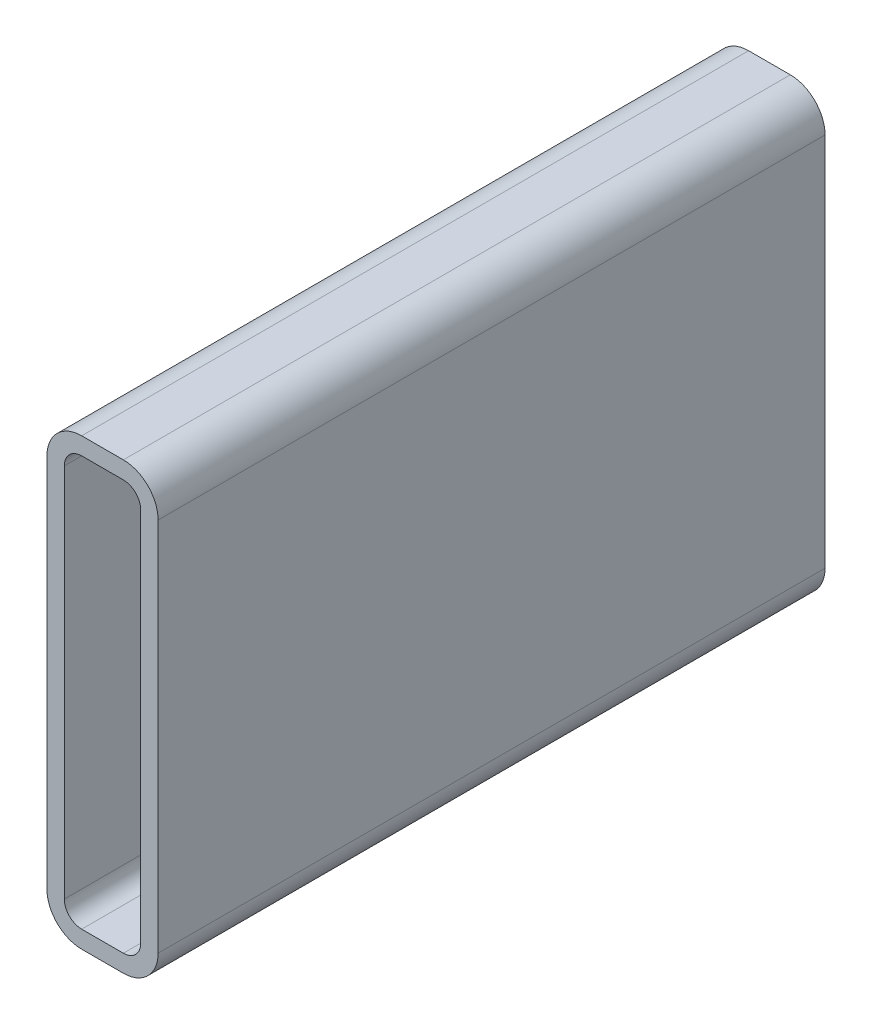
ISO-10303-21;
HEADER;
FILE_DESCRIPTION(('STEP AP214'),'2;1');
FILE_NAME('part.step','',(''),(''),'','','');
FILE_SCHEMA(('AUTOMOTIVE_DESIGN { 1 0 10303 214 1 1 1 1 }'));
ENDSEC;
DATA;
#1=APPLICATION_CONTEXT('core data for automotive mechanical design processes');
#2=APPLICATION_PROTOCOL_DEFINITION('international standard','automotive_design',2000,#1);
#3=PRODUCT_CONTEXT('',#1,'mechanical');
#4=PRODUCT('Part','Part','',(#3));
#5=PRODUCT_RELATED_PRODUCT_CATEGORY('part','',(#4));
#6=PRODUCT_DEFINITION_FORMATION('','',#4);
#7=PRODUCT_DEFINITION_CONTEXT('part definition',#1,'design');
#8=PRODUCT_DEFINITION('design','',#6,#7);
#9=PRODUCT_DEFINITION_SHAPE('','',#8);
#10=(LENGTH_UNIT() NAMED_UNIT(*) SI_UNIT(.MILLI.,.METRE.));
#11=(NAMED_UNIT(*) PLANE_ANGLE_UNIT() SI_UNIT($,.RADIAN.));
#12=(NAMED_UNIT(*) SI_UNIT($,.STERADIAN.) SOLID_ANGLE_UNIT());
#13=UNCERTAINTY_MEASURE_WITH_UNIT(LENGTH_MEASURE(1.E-05),#10,'distance_accuracy_value','');
#14=(GEOMETRIC_REPRESENTATION_CONTEXT(3) GLOBAL_UNCERTAINTY_ASSIGNED_CONTEXT((#13)) GLOBAL_UNIT_ASSIGNED_CONTEXT((#10,
#11,#12)) REPRESENTATION_CONTEXT('',''));
#15=CARTESIAN_POINT('',(0.,0.,0.));
#16=DIRECTION('',(0.,0.,1.));
#17=DIRECTION('',(1.,0.,0.));
#18=AXIS2_PLACEMENT_3D('',#15,#16,#17);
#19=CARTESIAN_POINT('',(15.875,187.325,304.8));
#20=DIRECTION('',(0.,0.,1.));
#21=DIRECTION('',(1.,0.,0.));
#22=AXIS2_PLACEMENT_3D('',#19,#20,#21);
#23=PLANE('',#22);
#24=CARTESIAN_POINT('',(15.875,187.325,304.8));
#25=DIRECTION('',(0.,0.,1.));
#26=DIRECTION('',(1.,0.,0.));
#27=AXIS2_PLACEMENT_3D('',#24,#25,#26);
#28=CIRCLE('',#27,15.875);
#29=CARTESIAN_POINT('',(15.875,203.2,304.8));
#30=VERTEX_POINT('',#29);
#31=CARTESIAN_POINT('',(0.,187.325,304.8));
#32=VERTEX_POINT('',#31);
#33=EDGE_CURVE('E211',#30,#32,#28,.T.);
#34=ORIENTED_EDGE('',*,*,#33,.T.);
#35=DIRECTION('',(0.,-1.,0.));
#36=VECTOR('',#35,1.);
#37=CARTESIAN_POINT('',(0.,15.875,304.8));
#38=LINE('',#37,#36);
#39=CARTESIAN_POINT('',(0.,15.875,304.8));
#40=VERTEX_POINT('',#39);
#41=EDGE_CURVE('E214',#32,#40,#38,.T.);
#42=ORIENTED_EDGE('',*,*,#41,.T.);
#43=CARTESIAN_POINT('',(15.875,15.875,304.8));
#44=DIRECTION('',(0.,0.,1.));
#45=DIRECTION('',(1.,0.,0.));
#46=AXIS2_PLACEMENT_3D('',#43,#44,#45);
#47=CIRCLE('',#46,15.875);
#48=CARTESIAN_POINT('',(15.875,0.,304.8));
#49=VERTEX_POINT('',#48);
#50=EDGE_CURVE('E217',#40,#49,#47,.T.);
#51=ORIENTED_EDGE('',*,*,#50,.T.);
#52=DIRECTION('',(1.,0.,0.));
#53=VECTOR('',#52,1.);
#54=CARTESIAN_POINT('',(34.925,0.,304.8));
#55=LINE('',#54,#53);
#56=CARTESIAN_POINT('',(34.925,0.,304.8));
#57=VERTEX_POINT('',#56);
#58=EDGE_CURVE('E219',#49,#57,#55,.T.);
#59=ORIENTED_EDGE('',*,*,#58,.T.);
#60=CARTESIAN_POINT('',(34.925,15.875,304.8));
#61=DIRECTION('',(0.,0.,1.));
#62=DIRECTION('',(1.,0.,0.));
#63=AXIS2_PLACEMENT_3D('',#60,#61,#62);
#64=CIRCLE('',#63,15.875);
#65=CARTESIAN_POINT('',(50.8,15.875,304.8));
#66=VERTEX_POINT('',#65);
#67=EDGE_CURVE('E221',#57,#66,#64,.T.);
#68=ORIENTED_EDGE('',*,*,#67,.T.);
#69=DIRECTION('',(0.,1.,0.));
#70=VECTOR('',#69,1.);
#71=CARTESIAN_POINT('',(50.8,187.325,304.8));
#72=LINE('',#71,#70);
#73=CARTESIAN_POINT('',(50.8,187.325,304.8));
#74=VERTEX_POINT('',#73);
#75=EDGE_CURVE('E223',#66,#74,#72,.T.);
#76=ORIENTED_EDGE('',*,*,#75,.T.);
#77=CARTESIAN_POINT('',(34.925,187.325,304.8));
#78=DIRECTION('',(0.,0.,1.));
#79=DIRECTION('',(1.,0.,0.));
#80=AXIS2_PLACEMENT_3D('',#77,#78,#79);
#81=CIRCLE('',#80,15.875);
#82=CARTESIAN_POINT('',(34.925,203.2,304.8));
#83=VERTEX_POINT('',#82);
#84=EDGE_CURVE('E225',#74,#83,#81,.T.);
#85=ORIENTED_EDGE('',*,*,#84,.T.);
#86=DIRECTION('',(-1.,0.,0.));
#87=VECTOR('',#86,1.);
#88=CARTESIAN_POINT('',(15.875,203.2,304.8));
#89=LINE('',#88,#87);
#90=EDGE_CURVE('E227',#83,#30,#89,.T.);
#91=ORIENTED_EDGE('',*,*,#90,.T.);
#92=EDGE_LOOP('',(#34,#42,#51,#59,#68,#76,#85,#91));
#93=FACE_BOUND('',#92,.T.);
#94=DIRECTION('',(0.,-1.,0.));
#95=VECTOR('',#94,1.);
#96=CARTESIAN_POINT('',(7.9375,15.875,304.8));
#97=LINE('',#96,#95);
#98=CARTESIAN_POINT('',(7.9375,187.325,304.8));
#99=VERTEX_POINT('',#98);
#100=CARTESIAN_POINT('',(7.9375,15.875,304.8));
#101=VERTEX_POINT('',#100);
#102=EDGE_CURVE('E154',#99,#101,#97,.T.);
#103=ORIENTED_EDGE('',*,*,#102,.F.);
#104=CARTESIAN_POINT('',(15.875,187.325,304.8));
#105=DIRECTION('',(0.,0.,1.));
#106=DIRECTION('',(1.,0.,0.));
#107=AXIS2_PLACEMENT_3D('',#104,#105,#106);
#108=CIRCLE('',#107,7.93749999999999);
#109=CARTESIAN_POINT('',(15.875,195.2625,304.8));
#110=VERTEX_POINT('',#109);
#111=EDGE_CURVE('E146',#110,#99,#108,.T.);
#112=ORIENTED_EDGE('',*,*,#111,.F.);
#113=DIRECTION('',(-1.,0.,0.));
#114=VECTOR('',#113,1.);
#115=CARTESIAN_POINT('',(15.875,195.2625,304.8));
#116=LINE('',#115,#114);
#117=CARTESIAN_POINT('',(34.925,195.2625,304.8));
#118=VERTEX_POINT('',#117);
#119=EDGE_CURVE('E179',#118,#110,#116,.T.);
#120=ORIENTED_EDGE('',*,*,#119,.F.);
#121=CARTESIAN_POINT('',(34.925,187.325,304.8));
#122=DIRECTION('',(0.,0.,1.));
#123=DIRECTION('',(1.,0.,0.));
#124=AXIS2_PLACEMENT_3D('',#121,#122,#123);
#125=CIRCLE('',#124,7.93749999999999);
#126=CARTESIAN_POINT('',(42.8625,187.325,304.8));
#127=VERTEX_POINT('',#126);
#128=EDGE_CURVE('E177',#127,#118,#125,.T.);
#129=ORIENTED_EDGE('',*,*,#128,.F.);
#130=DIRECTION('',(0.,1.,0.));
#131=VECTOR('',#130,1.);
#132=CARTESIAN_POINT('',(42.8625,187.325,304.8));
#133=LINE('',#132,#131);
#134=CARTESIAN_POINT('',(42.8625,15.875,304.8));
#135=VERTEX_POINT('',#134);
#136=EDGE_CURVE('E175',#135,#127,#133,.T.);
#137=ORIENTED_EDGE('',*,*,#136,.F.);
#138=CARTESIAN_POINT('',(34.925,15.875,304.8));
#139=DIRECTION('',(0.,0.,1.));
#140=DIRECTION('',(1.,0.,0.));
#141=AXIS2_PLACEMENT_3D('',#138,#139,#140);
#142=CIRCLE('',#141,7.9375);
#143=CARTESIAN_POINT('',(34.925,7.9375,304.8));
#144=VERTEX_POINT('',#143);
#145=EDGE_CURVE('E173',#144,#135,#142,.T.);
#146=ORIENTED_EDGE('',*,*,#145,.F.);
#147=DIRECTION('',(1.,0.,0.));
#148=VECTOR('',#147,1.);
#149=CARTESIAN_POINT('',(34.925,7.9375,304.8));
#150=LINE('',#149,#148);
#151=CARTESIAN_POINT('',(15.875,7.9375,304.8));
#152=VERTEX_POINT('',#151);
#153=EDGE_CURVE('E169',#152,#144,#150,.T.);
#154=ORIENTED_EDGE('',*,*,#153,.F.);
#155=CARTESIAN_POINT('',(15.875,15.875,304.8));
#156=DIRECTION('',(0.,0.,1.));
#157=DIRECTION('',(1.,0.,0.));
#158=AXIS2_PLACEMENT_3D('',#155,#156,#157);
#159=CIRCLE('',#158,7.9375);
#160=EDGE_CURVE('E167',#101,#152,#159,.T.);
#161=ORIENTED_EDGE('',*,*,#160,.F.);
#162=EDGE_LOOP('',(#103,#112,#120,#129,#137,#146,#154,#161));
#163=FACE_BOUND('',#162,.T.);
#164=ADVANCED_FACE('F33',(#93,#163),#23,.T.);
#165=CARTESIAN_POINT('',(15.875,187.325,0.));
#166=DIRECTION('',(0.,0.,1.));
#167=DIRECTION('',(1.,0.,0.));
#168=AXIS2_PLACEMENT_3D('',#165,#166,#167);
#169=PLANE('',#168);
#170=CARTESIAN_POINT('',(15.875,187.325,0.));
#171=DIRECTION('',(0.,0.,1.));
#172=DIRECTION('',(1.,0.,0.));
#173=AXIS2_PLACEMENT_3D('',#170,#171,#172);
#174=CIRCLE('',#173,15.875);
#175=CARTESIAN_POINT('',(15.875,203.2,0.));
#176=VERTEX_POINT('',#175);
#177=CARTESIAN_POINT('',(0.,187.325,0.));
#178=VERTEX_POINT('',#177);
#179=EDGE_CURVE('E162',#176,#178,#174,.T.);
#180=ORIENTED_EDGE('',*,*,#179,.F.);
#181=DIRECTION('',(-1.,0.,0.));
#182=VECTOR('',#181,1.);
#183=CARTESIAN_POINT('',(15.875,203.2,0.));
#184=LINE('',#183,#182);
#185=CARTESIAN_POINT('',(34.925,203.2,0.));
#186=VERTEX_POINT('',#185);
#187=EDGE_CURVE('E215',#186,#176,#184,.T.);
#188=ORIENTED_EDGE('',*,*,#187,.F.);
#189=CARTESIAN_POINT('',(34.925,187.325,0.));
#190=DIRECTION('',(0.,0.,1.));
#191=DIRECTION('',(1.,0.,0.));
#192=AXIS2_PLACEMENT_3D('',#189,#190,#191);
#193=CIRCLE('',#192,15.875);
#194=CARTESIAN_POINT('',(50.8,187.325,0.));
#195=VERTEX_POINT('',#194);
#196=EDGE_CURVE('E242',#195,#186,#193,.T.);
#197=ORIENTED_EDGE('',*,*,#196,.F.);
#198=DIRECTION('',(0.,1.,0.));
#199=VECTOR('',#198,1.);
#200=CARTESIAN_POINT('',(50.8,187.325,0.));
#201=LINE('',#200,#199);
#202=CARTESIAN_POINT('',(50.8,15.875,0.));
#203=VERTEX_POINT('',#202);
#204=EDGE_CURVE('E240',#203,#195,#201,.T.);
#205=ORIENTED_EDGE('',*,*,#204,.F.);
#206=CARTESIAN_POINT('',(34.925,15.875,0.));
#207=DIRECTION('',(0.,0.,1.));
#208=DIRECTION('',(1.,0.,0.));
#209=AXIS2_PLACEMENT_3D('',#206,#207,#208);
#210=CIRCLE('',#209,15.875);
#211=CARTESIAN_POINT('',(34.925,0.,0.));
#212=VERTEX_POINT('',#211);
#213=EDGE_CURVE('E238',#212,#203,#210,.T.);
#214=ORIENTED_EDGE('',*,*,#213,.F.);
#215=DIRECTION('',(1.,0.,0.));
#216=VECTOR('',#215,1.);
#217=CARTESIAN_POINT('',(34.925,0.,0.));
#218=LINE('',#217,#216);
#219=CARTESIAN_POINT('',(15.875,0.,0.));
#220=VERTEX_POINT('',#219);
#221=EDGE_CURVE('E236',#220,#212,#218,.T.);
#222=ORIENTED_EDGE('',*,*,#221,.F.);
#223=CARTESIAN_POINT('',(15.875,15.875,0.));
#224=DIRECTION('',(0.,0.,1.));
#225=DIRECTION('',(1.,0.,0.));
#226=AXIS2_PLACEMENT_3D('',#223,#224,#225);
#227=CIRCLE('',#226,15.875);
#228=CARTESIAN_POINT('',(0.,15.875,0.));
#229=VERTEX_POINT('',#228);
#230=EDGE_CURVE('E234',#229,#220,#227,.T.);
#231=ORIENTED_EDGE('',*,*,#230,.F.);
#232=DIRECTION('',(0.,-1.,0.));
#233=VECTOR('',#232,1.);
#234=CARTESIAN_POINT('',(0.,15.875,0.));
#235=LINE('',#234,#233);
#236=EDGE_CURVE('E232',#178,#229,#235,.T.);
#237=ORIENTED_EDGE('',*,*,#236,.F.);
#238=EDGE_LOOP('',(#180,#188,#197,#205,#214,#222,#231,#237));
#239=FACE_BOUND('',#238,.T.);
#240=CARTESIAN_POINT('',(15.875,187.325,0.));
#241=DIRECTION('',(0.,0.,1.));
#242=DIRECTION('',(1.,0.,0.));
#243=AXIS2_PLACEMENT_3D('',#240,#241,#242);
#244=CIRCLE('',#243,7.93749999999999);
#245=CARTESIAN_POINT('',(15.875,195.2625,0.));
#246=VERTEX_POINT('',#245);
#247=CARTESIAN_POINT('',(7.9375,187.325,0.));
#248=VERTEX_POINT('',#247);
#249=EDGE_CURVE('E56',#246,#248,#244,.T.);
#250=ORIENTED_EDGE('',*,*,#249,.T.);
#251=DIRECTION('',(0.,-1.,0.));
#252=VECTOR('',#251,1.);
#253=CARTESIAN_POINT('',(7.9375,15.875,0.));
#254=LINE('',#253,#252);
#255=CARTESIAN_POINT('',(7.9375,15.875,0.));
#256=VERTEX_POINT('',#255);
#257=EDGE_CURVE('E161',#248,#256,#254,.T.);
#258=ORIENTED_EDGE('',*,*,#257,.T.);
#259=CARTESIAN_POINT('',(15.875,15.875,0.));
#260=DIRECTION('',(0.,0.,1.));
#261=DIRECTION('',(1.,0.,0.));
#262=AXIS2_PLACEMENT_3D('',#259,#260,#261);
#263=CIRCLE('',#262,7.9375);
#264=CARTESIAN_POINT('',(15.875,7.9375,0.));
#265=VERTEX_POINT('',#264);
#266=EDGE_CURVE('E183',#256,#265,#263,.T.);
#267=ORIENTED_EDGE('',*,*,#266,.T.);
#268=DIRECTION('',(1.,0.,0.));
#269=VECTOR('',#268,1.);
#270=CARTESIAN_POINT('',(34.925,7.9375,0.));
#271=LINE('',#270,#269);
#272=CARTESIAN_POINT('',(34.925,7.9375,0.));
#273=VERTEX_POINT('',#272);
#274=EDGE_CURVE('E186',#265,#273,#271,.T.);
#275=ORIENTED_EDGE('',*,*,#274,.T.);
#276=CARTESIAN_POINT('',(34.925,15.875,0.));
#277=DIRECTION('',(0.,0.,1.));
#278=DIRECTION('',(1.,0.,0.));
#279=AXIS2_PLACEMENT_3D('',#276,#277,#278);
#280=CIRCLE('',#279,7.9375);
#281=CARTESIAN_POINT('',(42.8625,15.875,0.));
#282=VERTEX_POINT('',#281);
#283=EDGE_CURVE('E189',#273,#282,#280,.T.);
#284=ORIENTED_EDGE('',*,*,#283,.T.);
#285=DIRECTION('',(0.,1.,0.));
#286=VECTOR('',#285,1.);
#287=CARTESIAN_POINT('',(42.8625,187.325,0.));
#288=LINE('',#287,#286);
#289=CARTESIAN_POINT('',(42.8625,187.325,0.));
#290=VERTEX_POINT('',#289);
#291=EDGE_CURVE('E192',#282,#290,#288,.T.);
#292=ORIENTED_EDGE('',*,*,#291,.T.);
#293=CARTESIAN_POINT('',(34.925,187.325,0.));
#294=DIRECTION('',(0.,0.,1.));
#295=DIRECTION('',(1.,0.,0.));
#296=AXIS2_PLACEMENT_3D('',#293,#294,#295);
#297=CIRCLE('',#296,7.93749999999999);
#298=CARTESIAN_POINT('',(34.925,195.2625,0.));
#299=VERTEX_POINT('',#298);
#300=EDGE_CURVE('E195',#290,#299,#297,.T.);
#301=ORIENTED_EDGE('',*,*,#300,.T.);
#302=DIRECTION('',(-1.,0.,0.));
#303=VECTOR('',#302,1.);
#304=CARTESIAN_POINT('',(15.875,195.2625,0.));
#305=LINE('',#304,#303);
#306=EDGE_CURVE('E155',#299,#246,#305,.T.);
#307=ORIENTED_EDGE('',*,*,#306,.T.);
#308=EDGE_LOOP('',(#250,#258,#267,#275,#284,#292,#301,#307));
#309=FACE_BOUND('',#308,.T.);
#310=ADVANCED_FACE('F272',(#239,#309),#169,.F.);
#311=CARTESIAN_POINT('',(15.875,187.325,304.8));
#312=DIRECTION('',(0.,0.,-1.));
#313=DIRECTION('',(-1.,0.,0.));
#314=AXIS2_PLACEMENT_3D('',#311,#312,#313);
#315=CYLINDRICAL_SURFACE('',#314,15.875);
#316=ORIENTED_EDGE('',*,*,#179,.T.);
#317=DIRECTION('',(0.,0.,-1.));
#318=VECTOR('',#317,1.);
#319=CARTESIAN_POINT('',(0.,187.325,304.8));
#320=LINE('',#319,#318);
#321=EDGE_CURVE('E11',#32,#178,#320,.T.);
#322=ORIENTED_EDGE('',*,*,#321,.F.);
#323=ORIENTED_EDGE('',*,*,#33,.F.);
#324=DIRECTION('',(0.,0.,-1.));
#325=VECTOR('',#324,1.);
#326=CARTESIAN_POINT('',(15.875,203.2,304.8));
#327=LINE('',#326,#325);
#328=EDGE_CURVE('E229',#30,#176,#327,.T.);
#329=ORIENTED_EDGE('',*,*,#328,.T.);
#330=EDGE_LOOP('',(#316,#322,#323,#329));
#331=FACE_BOUND('',#330,.T.);
#332=ADVANCED_FACE('F35',(#331),#315,.T.);
#333=CARTESIAN_POINT('',(0.,15.875,304.8));
#334=DIRECTION('',(1.,0.,0.));
#335=DIRECTION('',(0.,0.,-1.));
#336=AXIS2_PLACEMENT_3D('',#333,#334,#335);
#337=PLANE('',#336);
#338=ORIENTED_EDGE('',*,*,#236,.T.);
#339=DIRECTION('',(0.,0.,-1.));
#340=VECTOR('',#339,1.);
#341=CARTESIAN_POINT('',(0.,15.875,304.8));
#342=LINE('',#341,#340);
#343=EDGE_CURVE('E41',#40,#229,#342,.T.);
#344=ORIENTED_EDGE('',*,*,#343,.F.);
#345=ORIENTED_EDGE('',*,*,#41,.F.);
#346=ORIENTED_EDGE('',*,*,#321,.T.);
#347=EDGE_LOOP('',(#338,#344,#345,#346));
#348=FACE_BOUND('',#347,.T.);
#349=ADVANCED_FACE('F289',(#348),#337,.F.);
#350=CARTESIAN_POINT('',(15.875,15.875,304.8));
#351=DIRECTION('',(0.,0.,-1.));
#352=DIRECTION('',(-1.,0.,0.));
#353=AXIS2_PLACEMENT_3D('',#350,#351,#352);
#354=CYLINDRICAL_SURFACE('',#353,15.875);
#355=ORIENTED_EDGE('',*,*,#230,.T.);
#356=DIRECTION('',(0.,0.,-1.));
#357=VECTOR('',#356,1.);
#358=CARTESIAN_POINT('',(15.875,0.,304.8));
#359=LINE('',#358,#357);
#360=EDGE_CURVE('E259',#49,#220,#359,.T.);
#361=ORIENTED_EDGE('',*,*,#360,.F.);
#362=ORIENTED_EDGE('',*,*,#50,.F.);
#363=ORIENTED_EDGE('',*,*,#343,.T.);
#364=EDGE_LOOP('',(#355,#361,#362,#363));
#365=FACE_BOUND('',#364,.T.);
#366=ADVANCED_FACE('F266',(#365),#354,.T.);
#367=CARTESIAN_POINT('',(34.925,0.,304.8));
#368=DIRECTION('',(0.,1.,0.));
#369=DIRECTION('',(0.,0.,1.));
#370=AXIS2_PLACEMENT_3D('',#367,#368,#369);
#371=PLANE('',#370);
#372=ORIENTED_EDGE('',*,*,#221,.T.);
#373=DIRECTION('',(0.,0.,-1.));
#374=VECTOR('',#373,1.);
#375=CARTESIAN_POINT('',(34.925,0.,304.8));
#376=LINE('',#375,#374);
#377=EDGE_CURVE('E256',#57,#212,#376,.T.);
#378=ORIENTED_EDGE('',*,*,#377,.F.);
#379=ORIENTED_EDGE('',*,*,#58,.F.);
#380=ORIENTED_EDGE('',*,*,#360,.T.);
#381=EDGE_LOOP('',(#372,#378,#379,#380));
#382=FACE_BOUND('',#381,.T.);
#383=ADVANCED_FACE('F278',(#382),#371,.F.);
#384=CARTESIAN_POINT('',(34.925,15.875,304.8));
#385=DIRECTION('',(0.,0.,-1.));
#386=DIRECTION('',(-1.,0.,0.));
#387=AXIS2_PLACEMENT_3D('',#384,#385,#386);
#388=CYLINDRICAL_SURFACE('',#387,15.875);
#389=ORIENTED_EDGE('',*,*,#213,.T.);
#390=DIRECTION('',(0.,0.,-1.));
#391=VECTOR('',#390,1.);
#392=CARTESIAN_POINT('',(50.8,15.875,304.8));
#393=LINE('',#392,#391);
#394=EDGE_CURVE('E253',#66,#203,#393,.T.);
#395=ORIENTED_EDGE('',*,*,#394,.F.);
#396=ORIENTED_EDGE('',*,*,#67,.F.);
#397=ORIENTED_EDGE('',*,*,#377,.T.);
#398=EDGE_LOOP('',(#389,#395,#396,#397));
#399=FACE_BOUND('',#398,.T.);
#400=ADVANCED_FACE('F282',(#399),#388,.T.);
#401=CARTESIAN_POINT('',(50.8,187.325,304.8));
#402=DIRECTION('',(-1.,0.,0.));
#403=DIRECTION('',(0.,0.,1.));
#404=AXIS2_PLACEMENT_3D('',#401,#402,#403);
#405=PLANE('',#404);
#406=ORIENTED_EDGE('',*,*,#204,.T.);
#407=DIRECTION('',(0.,0.,-1.));
#408=VECTOR('',#407,1.);
#409=CARTESIAN_POINT('',(50.8,187.325,304.8));
#410=LINE('',#409,#408);
#411=EDGE_CURVE('E250',#74,#195,#410,.T.);
#412=ORIENTED_EDGE('',*,*,#411,.F.);
#413=ORIENTED_EDGE('',*,*,#75,.F.);
#414=ORIENTED_EDGE('',*,*,#394,.T.);
#415=EDGE_LOOP('',(#406,#412,#413,#414));
#416=FACE_BOUND('',#415,.T.);
#417=ADVANCED_FACE('F302',(#416),#405,.F.);
#418=CARTESIAN_POINT('',(34.925,187.325,304.8));
#419=DIRECTION('',(0.,0.,-1.));
#420=DIRECTION('',(-1.,0.,0.));
#421=AXIS2_PLACEMENT_3D('',#418,#419,#420);
#422=CYLINDRICAL_SURFACE('',#421,15.875);
#423=ORIENTED_EDGE('',*,*,#196,.T.);
#424=DIRECTION('',(0.,0.,-1.));
#425=VECTOR('',#424,1.);
#426=CARTESIAN_POINT('',(34.925,203.2,304.8));
#427=LINE('',#426,#425);
#428=EDGE_CURVE('E247',#83,#186,#427,.T.);
#429=ORIENTED_EDGE('',*,*,#428,.F.);
#430=ORIENTED_EDGE('',*,*,#84,.F.);
#431=ORIENTED_EDGE('',*,*,#411,.T.);
#432=EDGE_LOOP('',(#423,#429,#430,#431));
#433=FACE_BOUND('',#432,.T.);
#434=ADVANCED_FACE('F300',(#433),#422,.T.);
#435=CARTESIAN_POINT('',(15.875,203.2,304.8));
#436=DIRECTION('',(0.,-1.,0.));
#437=DIRECTION('',(0.,0.,-1.));
#438=AXIS2_PLACEMENT_3D('',#435,#436,#437);
#439=PLANE('',#438);
#440=ORIENTED_EDGE('',*,*,#187,.T.);
#441=ORIENTED_EDGE('',*,*,#328,.F.);
#442=ORIENTED_EDGE('',*,*,#90,.F.);
#443=ORIENTED_EDGE('',*,*,#428,.T.);
#444=EDGE_LOOP('',(#440,#441,#442,#443));
#445=FACE_BOUND('',#444,.T.);
#446=ADVANCED_FACE('F295',(#445),#439,.F.);
#447=CARTESIAN_POINT('',(15.875,187.325,304.8));
#448=DIRECTION('',(0.,0.,-1.));
#449=DIRECTION('',(-1.,0.,0.));
#450=AXIS2_PLACEMENT_3D('',#447,#448,#449);
#451=CYLINDRICAL_SURFACE('',#450,7.93749999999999);
#452=ORIENTED_EDGE('',*,*,#249,.F.);
#453=DIRECTION('',(0.,0.,-1.));
#454=VECTOR('',#453,1.);
#455=CARTESIAN_POINT('',(15.875,195.2625,304.8));
#456=LINE('',#455,#454);
#457=EDGE_CURVE('E150',#110,#246,#456,.T.);
#458=ORIENTED_EDGE('',*,*,#457,.F.);
#459=ORIENTED_EDGE('',*,*,#111,.T.);
#460=DIRECTION('',(0.,0.,-1.));
#461=VECTOR('',#460,1.);
#462=CARTESIAN_POINT('',(7.9375,187.325,304.8));
#463=LINE('',#462,#461);
#464=EDGE_CURVE('E149',#99,#248,#463,.T.);
#465=ORIENTED_EDGE('',*,*,#464,.T.);
#466=EDGE_LOOP('',(#452,#458,#459,#465));
#467=FACE_BOUND('',#466,.T.);
#468=ADVANCED_FACE('F148',(#467),#451,.F.);
#469=CARTESIAN_POINT('',(7.9375,15.875,304.8));
#470=DIRECTION('',(1.,0.,0.));
#471=DIRECTION('',(0.,0.,-1.));
#472=AXIS2_PLACEMENT_3D('',#469,#470,#471);
#473=PLANE('',#472);
#474=ORIENTED_EDGE('',*,*,#257,.F.);
#475=ORIENTED_EDGE('',*,*,#464,.F.);
#476=ORIENTED_EDGE('',*,*,#102,.T.);
#477=DIRECTION('',(0.,0.,-1.));
#478=VECTOR('',#477,1.);
#479=CARTESIAN_POINT('',(7.9375,15.875,304.8));
#480=LINE('',#479,#478);
#481=EDGE_CURVE('E163',#101,#256,#480,.T.);
#482=ORIENTED_EDGE('',*,*,#481,.T.);
#483=EDGE_LOOP('',(#474,#475,#476,#482));
#484=FACE_BOUND('',#483,.T.);
#485=ADVANCED_FACE('F158',(#484),#473,.T.);
#486=CARTESIAN_POINT('',(15.875,15.875,304.8));
#487=DIRECTION('',(0.,0.,-1.));
#488=DIRECTION('',(-1.,0.,0.));
#489=AXIS2_PLACEMENT_3D('',#486,#487,#488);
#490=CYLINDRICAL_SURFACE('',#489,7.9375);
#491=ORIENTED_EDGE('',*,*,#266,.F.);
#492=ORIENTED_EDGE('',*,*,#481,.F.);
#493=ORIENTED_EDGE('',*,*,#160,.T.);
#494=DIRECTION('',(0.,0.,-1.));
#495=VECTOR('',#494,1.);
#496=CARTESIAN_POINT('',(15.875,7.9375,304.8));
#497=LINE('',#496,#495);
#498=EDGE_CURVE('E208',#152,#265,#497,.T.);
#499=ORIENTED_EDGE('',*,*,#498,.T.);
#500=EDGE_LOOP('',(#491,#492,#493,#499));
#501=FACE_BOUND('',#500,.T.);
#502=ADVANCED_FACE('F327',(#501),#490,.F.);
#503=CARTESIAN_POINT('',(34.925,7.9375,304.8));
#504=DIRECTION('',(0.,1.,0.));
#505=DIRECTION('',(0.,0.,1.));
#506=AXIS2_PLACEMENT_3D('',#503,#504,#505);
#507=PLANE('',#506);
#508=ORIENTED_EDGE('',*,*,#274,.F.);
#509=ORIENTED_EDGE('',*,*,#498,.F.);
#510=ORIENTED_EDGE('',*,*,#153,.T.);
#511=DIRECTION('',(0.,0.,-1.));
#512=VECTOR('',#511,1.);
#513=CARTESIAN_POINT('',(34.925,7.9375,304.8));
#514=LINE('',#513,#512);
#515=EDGE_CURVE('E206',#144,#273,#514,.T.);
#516=ORIENTED_EDGE('',*,*,#515,.T.);
#517=EDGE_LOOP('',(#508,#509,#510,#516));
#518=FACE_BOUND('',#517,.T.);
#519=ADVANCED_FACE('F331',(#518),#507,.T.);
#520=CARTESIAN_POINT('',(34.925,15.875,304.8));
#521=DIRECTION('',(0.,0.,-1.));
#522=DIRECTION('',(-1.,0.,0.));
#523=AXIS2_PLACEMENT_3D('',#520,#521,#522);
#524=CYLINDRICAL_SURFACE('',#523,7.9375);
#525=ORIENTED_EDGE('',*,*,#283,.F.);
#526=ORIENTED_EDGE('',*,*,#515,.F.);
#527=ORIENTED_EDGE('',*,*,#145,.T.);
#528=DIRECTION('',(0.,0.,-1.));
#529=VECTOR('',#528,1.);
#530=CARTESIAN_POINT('',(42.8625,15.875,304.8));
#531=LINE('',#530,#529);
#532=EDGE_CURVE('E204',#135,#282,#531,.T.);
#533=ORIENTED_EDGE('',*,*,#532,.T.);
#534=EDGE_LOOP('',(#525,#526,#527,#533));
#535=FACE_BOUND('',#534,.T.);
#536=ADVANCED_FACE('F337',(#535),#524,.F.);
#537=CARTESIAN_POINT('',(42.8625,187.325,304.8));
#538=DIRECTION('',(-1.,0.,0.));
#539=DIRECTION('',(0.,0.,1.));
#540=AXIS2_PLACEMENT_3D('',#537,#538,#539);
#541=PLANE('',#540);
#542=ORIENTED_EDGE('',*,*,#291,.F.);
#543=ORIENTED_EDGE('',*,*,#532,.F.);
#544=ORIENTED_EDGE('',*,*,#136,.T.);
#545=DIRECTION('',(0.,0.,-1.));
#546=VECTOR('',#545,1.);
#547=CARTESIAN_POINT('',(42.8625,187.325,304.8));
#548=LINE('',#547,#546);
#549=EDGE_CURVE('E202',#127,#290,#548,.T.);
#550=ORIENTED_EDGE('',*,*,#549,.T.);
#551=EDGE_LOOP('',(#542,#543,#544,#550));
#552=FACE_BOUND('',#551,.T.);
#553=ADVANCED_FACE('F341',(#552),#541,.T.);
#554=CARTESIAN_POINT('',(34.925,187.325,304.8));
#555=DIRECTION('',(0.,0.,-1.));
#556=DIRECTION('',(-1.,0.,0.));
#557=AXIS2_PLACEMENT_3D('',#554,#555,#556);
#558=CYLINDRICAL_SURFACE('',#557,7.93749999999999);
#559=ORIENTED_EDGE('',*,*,#300,.F.);
#560=ORIENTED_EDGE('',*,*,#549,.F.);
#561=ORIENTED_EDGE('',*,*,#128,.T.);
#562=DIRECTION('',(0.,0.,-1.));
#563=VECTOR('',#562,1.);
#564=CARTESIAN_POINT('',(34.925,195.2625,304.8));
#565=LINE('',#564,#563);
#566=EDGE_CURVE('E48',#118,#299,#565,.T.);
#567=ORIENTED_EDGE('',*,*,#566,.T.);
#568=EDGE_LOOP('',(#559,#560,#561,#567));
#569=FACE_BOUND('',#568,.T.);
#570=ADVANCED_FACE('F345',(#569),#558,.F.);
#571=CARTESIAN_POINT('',(15.875,195.2625,304.8));
#572=DIRECTION('',(0.,-1.,0.));
#573=DIRECTION('',(0.,0.,-1.));
#574=AXIS2_PLACEMENT_3D('',#571,#572,#573);
#575=PLANE('',#574);
#576=ORIENTED_EDGE('',*,*,#306,.F.);
#577=ORIENTED_EDGE('',*,*,#566,.F.);
#578=ORIENTED_EDGE('',*,*,#119,.T.);
#579=ORIENTED_EDGE('',*,*,#457,.T.);
#580=EDGE_LOOP('',(#576,#577,#578,#579));
#581=FACE_BOUND('',#580,.T.);
#582=ADVANCED_FACE('F349',(#581),#575,.T.);
#583=CLOSED_SHELL('',(#164,#310,#332,#349,#366,#383,#400,#417,#434,#446,#468,#485,#502,#519,
#536,#553,#570,#582));
#584=MANIFOLD_SOLID_BREP('B2',#583);
#585=ADVANCED_BREP_SHAPE_REPRESENTATION('',(#18,#584),#14);
#586=SHAPE_DEFINITION_REPRESENTATION(#9,#585);
ENDSEC;
END-ISO-10303-21;
